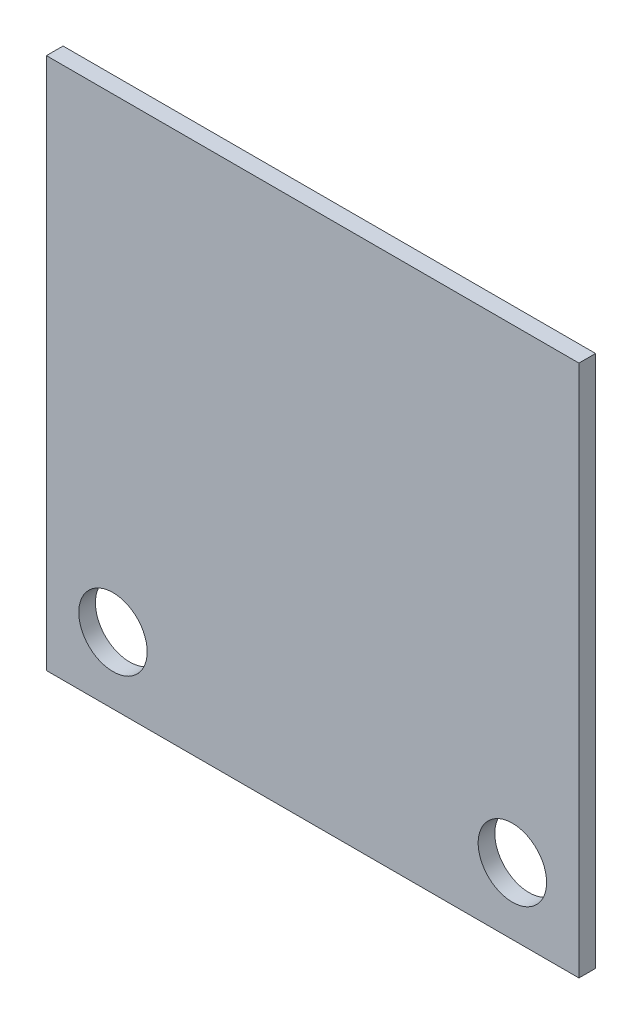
ISO-10303-21;
HEADER;
FILE_DESCRIPTION(('STEP AP214'),'2;1');
FILE_NAME('part.step','',(''),(''),'','','');
FILE_SCHEMA(('AUTOMOTIVE_DESIGN { 1 0 10303 214 1 1 1 1 }'));
ENDSEC;
DATA;
#1=APPLICATION_CONTEXT('core data for automotive mechanical design processes');
#2=APPLICATION_PROTOCOL_DEFINITION('international standard','automotive_design',2000,#1);
#3=PRODUCT_CONTEXT('',#1,'mechanical');
#4=PRODUCT('Part','Part','',(#3));
#5=PRODUCT_RELATED_PRODUCT_CATEGORY('part','',(#4));
#6=PRODUCT_DEFINITION_FORMATION('','',#4);
#7=PRODUCT_DEFINITION_CONTEXT('part definition',#1,'design');
#8=PRODUCT_DEFINITION('design','',#6,#7);
#9=PRODUCT_DEFINITION_SHAPE('','',#8);
#10=(LENGTH_UNIT() NAMED_UNIT(*) SI_UNIT(.MILLI.,.METRE.));
#11=(NAMED_UNIT(*) PLANE_ANGLE_UNIT() SI_UNIT($,.RADIAN.));
#12=(NAMED_UNIT(*) SI_UNIT($,.STERADIAN.) SOLID_ANGLE_UNIT());
#13=UNCERTAINTY_MEASURE_WITH_UNIT(LENGTH_MEASURE(1.E-05),#10,'distance_accuracy_value','');
#14=(GEOMETRIC_REPRESENTATION_CONTEXT(3) GLOBAL_UNCERTAINTY_ASSIGNED_CONTEXT((#13)) GLOBAL_UNIT_ASSIGNED_CONTEXT((#10,
#11,#12)) REPRESENTATION_CONTEXT('',''));
#15=CARTESIAN_POINT('',(0.,0.,0.));
#16=DIRECTION('',(0.,0.,1.));
#17=DIRECTION('',(1.,0.,0.));
#18=AXIS2_PLACEMENT_3D('',#15,#16,#17);
#19=CARTESIAN_POINT('',(-12.7,25.4,0.79375));
#20=DIRECTION('',(1.,0.,0.));
#21=DIRECTION('',(0.,1.,0.));
#22=AXIS2_PLACEMENT_3D('',#19,#20,#21);
#23=PLANE('',#22);
#24=DIRECTION('',(0.,-1.,0.));
#25=VECTOR('',#24,1.);
#26=CARTESIAN_POINT('',(-12.7,25.4,0.));
#27=LINE('',#26,#25);
#28=CARTESIAN_POINT('',(-12.7,25.4,0.));
#29=VERTEX_POINT('',#28);
#30=CARTESIAN_POINT('',(-12.7,0.,0.));
#31=VERTEX_POINT('',#30);
#32=EDGE_CURVE('E95',#29,#31,#27,.T.);
#33=ORIENTED_EDGE('',*,*,#32,.T.);
#34=DIRECTION('',(0.,0.,-1.));
#35=VECTOR('',#34,1.);
#36=CARTESIAN_POINT('',(-12.7,0.,0.79375));
#37=LINE('',#36,#35);
#38=CARTESIAN_POINT('',(-12.7,0.,0.79375));
#39=VERTEX_POINT('',#38);
#40=EDGE_CURVE('E11',#39,#31,#37,.T.);
#41=ORIENTED_EDGE('',*,*,#40,.F.);
#42=DIRECTION('',(0.,-1.,0.));
#43=VECTOR('',#42,1.);
#44=CARTESIAN_POINT('',(-12.7,25.4,0.79375));
#45=LINE('',#44,#43);
#46=CARTESIAN_POINT('',(-12.7,25.4,0.79375));
#47=VERTEX_POINT('',#46);
#48=EDGE_CURVE('E83',#47,#39,#45,.T.);
#49=ORIENTED_EDGE('',*,*,#48,.F.);
#50=DIRECTION('',(0.,0.,-1.));
#51=VECTOR('',#50,1.);
#52=CARTESIAN_POINT('',(-12.7,25.4,0.79375));
#53=LINE('',#52,#51);
#54=EDGE_CURVE('E91',#47,#29,#53,.T.);
#55=ORIENTED_EDGE('',*,*,#54,.T.);
#56=EDGE_LOOP('',(#33,#41,#49,#55));
#57=FACE_BOUND('',#56,.T.);
#58=ADVANCED_FACE('F32',(#57),#23,.F.);
#59=CARTESIAN_POINT('',(-12.7,0.,0.79375));
#60=DIRECTION('',(0.,1.,0.));
#61=DIRECTION('',(-1.,0.,0.));
#62=AXIS2_PLACEMENT_3D('',#59,#60,#61);
#63=PLANE('',#62);
#64=DIRECTION('',(1.,0.,0.));
#65=VECTOR('',#64,1.);
#66=CARTESIAN_POINT('',(-12.7,0.,0.));
#67=LINE('',#66,#65);
#68=CARTESIAN_POINT('',(12.7,0.,0.));
#69=VERTEX_POINT('',#68);
#70=EDGE_CURVE('E87',#31,#69,#67,.T.);
#71=ORIENTED_EDGE('',*,*,#70,.T.);
#72=DIRECTION('',(0.,0.,-1.));
#73=VECTOR('',#72,1.);
#74=CARTESIAN_POINT('',(12.7,0.,0.79375));
#75=LINE('',#74,#73);
#76=CARTESIAN_POINT('',(12.7,0.,0.79375));
#77=VERTEX_POINT('',#76);
#78=EDGE_CURVE('E40',#77,#69,#75,.T.);
#79=ORIENTED_EDGE('',*,*,#78,.F.);
#80=DIRECTION('',(1.,0.,0.));
#81=VECTOR('',#80,1.);
#82=CARTESIAN_POINT('',(-12.7,0.,0.79375));
#83=LINE('',#82,#81);
#84=EDGE_CURVE('E78',#39,#77,#83,.T.);
#85=ORIENTED_EDGE('',*,*,#84,.F.);
#86=ORIENTED_EDGE('',*,*,#40,.T.);
#87=EDGE_LOOP('',(#71,#79,#85,#86));
#88=FACE_BOUND('',#87,.T.);
#89=ADVANCED_FACE('F86',(#88),#63,.F.);
#90=CARTESIAN_POINT('',(12.7,25.4,0.79375));
#91=DIRECTION('',(-1.,0.,0.));
#92=DIRECTION('',(0.,-1.,0.));
#93=AXIS2_PLACEMENT_3D('',#90,#91,#92);
#94=PLANE('',#93);
#95=DIRECTION('',(0.,1.,0.));
#96=VECTOR('',#95,1.);
#97=CARTESIAN_POINT('',(12.7,25.4,0.));
#98=LINE('',#97,#96);
#99=CARTESIAN_POINT('',(12.7,25.4,0.));
#100=VERTEX_POINT('',#99);
#101=EDGE_CURVE('E65',#69,#100,#98,.T.);
#102=ORIENTED_EDGE('',*,*,#101,.T.);
#103=DIRECTION('',(0.,0.,-1.));
#104=VECTOR('',#103,1.);
#105=CARTESIAN_POINT('',(12.7,25.4,0.79375));
#106=LINE('',#105,#104);
#107=CARTESIAN_POINT('',(12.7,25.4,0.79375));
#108=VERTEX_POINT('',#107);
#109=EDGE_CURVE('E88',#108,#100,#106,.T.);
#110=ORIENTED_EDGE('',*,*,#109,.F.);
#111=DIRECTION('',(0.,1.,0.));
#112=VECTOR('',#111,1.);
#113=CARTESIAN_POINT('',(12.7,25.4,0.79375));
#114=LINE('',#113,#112);
#115=EDGE_CURVE('E81',#77,#108,#114,.T.);
#116=ORIENTED_EDGE('',*,*,#115,.F.);
#117=ORIENTED_EDGE('',*,*,#78,.T.);
#118=EDGE_LOOP('',(#102,#110,#116,#117));
#119=FACE_BOUND('',#118,.T.);
#120=ADVANCED_FACE('F89',(#119),#94,.F.);
#121=CARTESIAN_POINT('',(-12.7,25.4,0.79375));
#122=DIRECTION('',(0.,-1.,0.));
#123=DIRECTION('',(1.,0.,0.));
#124=AXIS2_PLACEMENT_3D('',#121,#122,#123);
#125=PLANE('',#124);
#126=DIRECTION('',(-1.,0.,0.));
#127=VECTOR('',#126,1.);
#128=CARTESIAN_POINT('',(-12.7,25.4,0.));
#129=LINE('',#128,#127);
#130=EDGE_CURVE('E71',#100,#29,#129,.T.);
#131=ORIENTED_EDGE('',*,*,#130,.T.);
#132=ORIENTED_EDGE('',*,*,#54,.F.);
#133=DIRECTION('',(-1.,0.,0.));
#134=VECTOR('',#133,1.);
#135=CARTESIAN_POINT('',(-12.7,25.4,0.79375));
#136=LINE('',#135,#134);
#137=EDGE_CURVE('E48',#108,#47,#136,.T.);
#138=ORIENTED_EDGE('',*,*,#137,.F.);
#139=ORIENTED_EDGE('',*,*,#109,.T.);
#140=EDGE_LOOP('',(#131,#132,#138,#139));
#141=FACE_BOUND('',#140,.T.);
#142=ADVANCED_FACE('F103',(#141),#125,.F.);
#143=CARTESIAN_POINT('',(-12.7,25.4,0.79375));
#144=DIRECTION('',(0.,0.,1.));
#145=DIRECTION('',(1.,0.,0.));
#146=AXIS2_PLACEMENT_3D('',#143,#144,#145);
#147=PLANE('',#146);
#148=CARTESIAN_POINT('',(-9.525,3.175,0.79375));
#149=DIRECTION('',(0.,0.,1.));
#150=DIRECTION('',(1.,0.,0.));
#151=AXIS2_PLACEMENT_3D('',#148,#149,#150);
#152=CIRCLE('',#151,1.63194999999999);
#153=CARTESIAN_POINT('',(-7.89305000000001,3.175,0.79375));
#154=VERTEX_POINT('',#153);
#155=EDGE_CURVE('E117',#154,#154,#152,.T.);
#156=ORIENTED_EDGE('',*,*,#155,.F.);
#157=EDGE_LOOP('',(#156));
#158=FACE_BOUND('',#157,.T.);
#159=CARTESIAN_POINT('',(9.525,3.175,0.79375));
#160=DIRECTION('',(0.,0.,1.));
#161=DIRECTION('',(1.,0.,0.));
#162=AXIS2_PLACEMENT_3D('',#159,#160,#161);
#163=CIRCLE('',#162,1.63194999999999);
#164=CARTESIAN_POINT('',(11.15695,3.175,0.79375));
#165=VERTEX_POINT('',#164);
#166=EDGE_CURVE('E111',#165,#165,#163,.T.);
#167=ORIENTED_EDGE('',*,*,#166,.F.);
#168=EDGE_LOOP('',(#167));
#169=FACE_BOUND('',#168,.T.);
#170=ORIENTED_EDGE('',*,*,#48,.T.);
#171=ORIENTED_EDGE('',*,*,#84,.T.);
#172=ORIENTED_EDGE('',*,*,#115,.T.);
#173=ORIENTED_EDGE('',*,*,#137,.T.);
#174=EDGE_LOOP('',(#170,#171,#172,#173));
#175=FACE_BOUND('',#174,.T.);
#176=ADVANCED_FACE('F79',(#158,#169,#175),#147,.T.);
#177=CARTESIAN_POINT('',(-12.7,25.4,0.));
#178=DIRECTION('',(0.,0.,1.));
#179=DIRECTION('',(1.,0.,0.));
#180=AXIS2_PLACEMENT_3D('',#177,#178,#179);
#181=PLANE('',#180);
#182=CARTESIAN_POINT('',(-9.525,3.175,0.));
#183=DIRECTION('',(0.,0.,1.));
#184=DIRECTION('',(1.,0.,0.));
#185=AXIS2_PLACEMENT_3D('',#182,#183,#184);
#186=CIRCLE('',#185,1.63195);
#187=CARTESIAN_POINT('',(-7.89305,3.175,0.));
#188=VERTEX_POINT('',#187);
#189=EDGE_CURVE('E114',#188,#188,#186,.T.);
#190=ORIENTED_EDGE('',*,*,#189,.T.);
#191=EDGE_LOOP('',(#190));
#192=FACE_BOUND('',#191,.T.);
#193=CARTESIAN_POINT('',(9.525,3.175,0.));
#194=DIRECTION('',(0.,0.,1.));
#195=DIRECTION('',(1.,0.,0.));
#196=AXIS2_PLACEMENT_3D('',#193,#194,#195);
#197=CIRCLE('',#196,1.63195);
#198=CARTESIAN_POINT('',(11.15695,3.175,0.));
#199=VERTEX_POINT('',#198);
#200=EDGE_CURVE('E98',#199,#199,#197,.T.);
#201=ORIENTED_EDGE('',*,*,#200,.T.);
#202=EDGE_LOOP('',(#201));
#203=FACE_BOUND('',#202,.T.);
#204=ORIENTED_EDGE('',*,*,#32,.F.);
#205=ORIENTED_EDGE('',*,*,#130,.F.);
#206=ORIENTED_EDGE('',*,*,#101,.F.);
#207=ORIENTED_EDGE('',*,*,#70,.F.);
#208=EDGE_LOOP('',(#204,#205,#206,#207));
#209=FACE_BOUND('',#208,.T.);
#210=ADVANCED_FACE('F106',(#192,#203,#209),#181,.F.);
#211=CARTESIAN_POINT('',(9.525,3.175,0.793749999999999));
#212=DIRECTION('',(0.,0.,1.));
#213=DIRECTION('',(1.,0.,0.));
#214=AXIS2_PLACEMENT_3D('',#211,#212,#213);
#215=CYLINDRICAL_SURFACE('',#214,1.63194999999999);
#216=ORIENTED_EDGE('',*,*,#200,.F.);
#217=EDGE_LOOP('',(#216));
#218=FACE_BOUND('',#217,.T.);
#219=ORIENTED_EDGE('',*,*,#166,.T.);
#220=EDGE_LOOP('',(#219));
#221=FACE_BOUND('',#220,.T.);
#222=ADVANCED_FACE('F128',(#218,#221),#215,.F.);
#223=CARTESIAN_POINT('',(-9.525,3.175,0.793749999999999));
#224=DIRECTION('',(0.,0.,1.));
#225=DIRECTION('',(1.,0.,0.));
#226=AXIS2_PLACEMENT_3D('',#223,#224,#225);
#227=CYLINDRICAL_SURFACE('',#226,1.63194999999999);
#228=ORIENTED_EDGE('',*,*,#189,.F.);
#229=EDGE_LOOP('',(#228));
#230=FACE_BOUND('',#229,.T.);
#231=ORIENTED_EDGE('',*,*,#155,.T.);
#232=EDGE_LOOP('',(#231));
#233=FACE_BOUND('',#232,.T.);
#234=ADVANCED_FACE('F121',(#230,#233),#227,.F.);
#235=CLOSED_SHELL('',(#58,#89,#120,#142,#176,#210,#222,#234));
#236=MANIFOLD_SOLID_BREP('B2',#235);
#237=ADVANCED_BREP_SHAPE_REPRESENTATION('',(#18,#236),#14);
#238=SHAPE_DEFINITION_REPRESENTATION(#9,#237);
ENDSEC;
END-ISO-10303-21;
